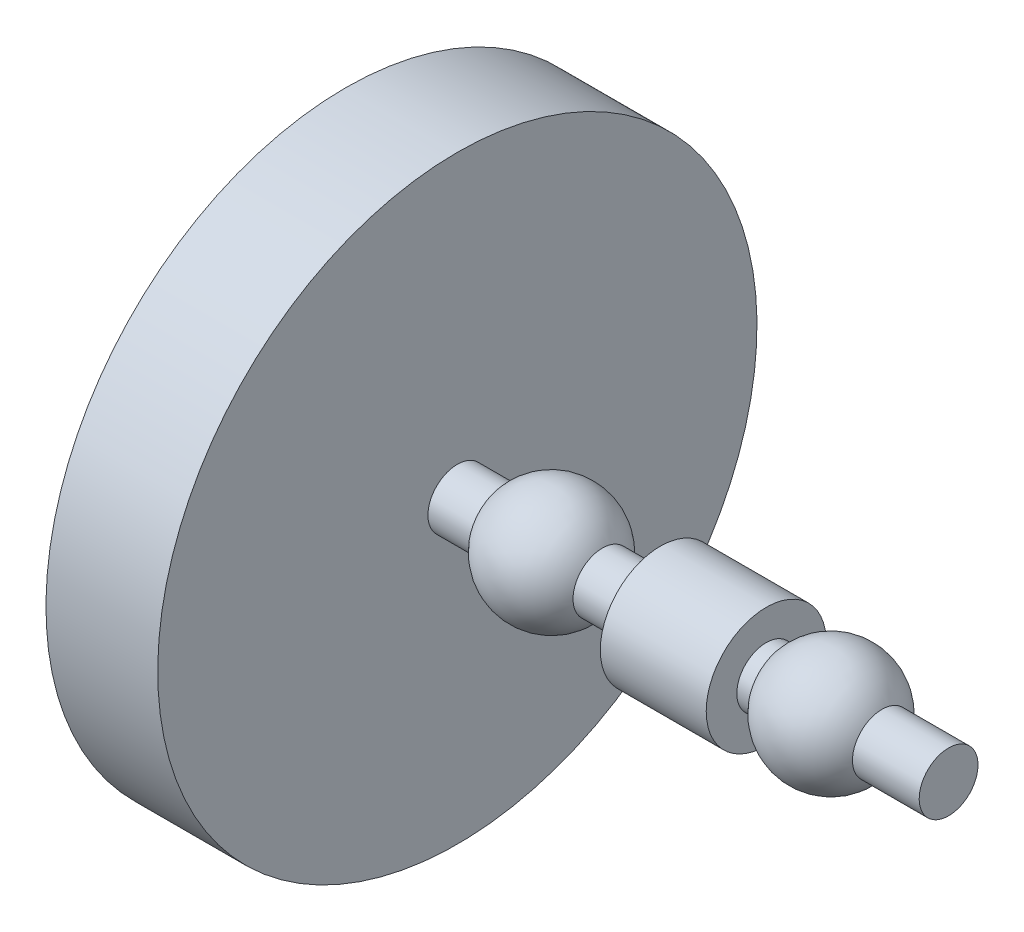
ISO-10303-21;
HEADER;
FILE_DESCRIPTION(('STEP AP214'),'2;1');
FILE_NAME('part.step','',(''),(''),'','','');
FILE_SCHEMA(('AUTOMOTIVE_DESIGN { 1 0 10303 214 1 1 1 1 }'));
ENDSEC;
DATA;
#1=APPLICATION_CONTEXT('core data for automotive mechanical design processes');
#2=APPLICATION_PROTOCOL_DEFINITION('international standard','automotive_design',2000,#1);
#3=PRODUCT_CONTEXT('',#1,'mechanical');
#4=PRODUCT('Part','Part','',(#3));
#5=PRODUCT_RELATED_PRODUCT_CATEGORY('part','',(#4));
#6=PRODUCT_DEFINITION_FORMATION('','',#4);
#7=PRODUCT_DEFINITION_CONTEXT('part definition',#1,'design');
#8=PRODUCT_DEFINITION('design','',#6,#7);
#9=PRODUCT_DEFINITION_SHAPE('','',#8);
#10=(LENGTH_UNIT() NAMED_UNIT(*) SI_UNIT(.MILLI.,.METRE.));
#11=(NAMED_UNIT(*) PLANE_ANGLE_UNIT() SI_UNIT($,.RADIAN.));
#12=(NAMED_UNIT(*) SI_UNIT($,.STERADIAN.) SOLID_ANGLE_UNIT());
#13=UNCERTAINTY_MEASURE_WITH_UNIT(LENGTH_MEASURE(1.E-05),#10,'distance_accuracy_value','');
#14=(GEOMETRIC_REPRESENTATION_CONTEXT(3) GLOBAL_UNCERTAINTY_ASSIGNED_CONTEXT((#13)) GLOBAL_UNIT_ASSIGNED_CONTEXT((#10,
#11,#12)) REPRESENTATION_CONTEXT('',''));
#15=CARTESIAN_POINT('',(0.,0.,0.));
#16=DIRECTION('',(0.,0.,1.));
#17=DIRECTION('',(1.,0.,0.));
#18=AXIS2_PLACEMENT_3D('',#15,#16,#17);
#19=CARTESIAN_POINT('',(0.,0.,0.));
#20=DIRECTION('',(1.,0.,0.));
#21=DIRECTION('',(0.,1.,0.));
#22=AXIS2_PLACEMENT_3D('',#19,#20,#21);
#23=CYLINDRICAL_SURFACE('',#22,5.);
#24=CARTESIAN_POINT('',(8.66025403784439,0.,0.));
#25=DIRECTION('',(1.,0.,0.));
#26=DIRECTION('',(0.,1.,0.));
#27=AXIS2_PLACEMENT_3D('',#24,#25,#26);
#28=CIRCLE('',#27,5.);
#29=CARTESIAN_POINT('',(8.66025403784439,5.,0.));
#30=VERTEX_POINT('',#29);
#31=EDGE_CURVE('E190',#30,#30,#28,.T.);
#32=ORIENTED_EDGE('',*,*,#31,.T.);
#33=EDGE_LOOP('',(#32));
#34=FACE_BOUND('',#33,.T.);
#35=CARTESIAN_POINT('',(18.5,0.,0.));
#36=DIRECTION('',(1.,0.,0.));
#37=DIRECTION('',(0.,0.,-1.));
#38=AXIS2_PLACEMENT_3D('',#35,#36,#37);
#39=CIRCLE('',#38,5.);
#40=CARTESIAN_POINT('',(18.5,0.,-5.));
#41=VERTEX_POINT('',#40);
#42=EDGE_CURVE('E37',#41,#41,#39,.F.);
#43=ORIENTED_EDGE('',*,*,#42,.T.);
#44=EDGE_LOOP('',(#43));
#45=FACE_BOUND('',#44,.T.);
#46=ADVANCED_FACE('F33',(#34,#45),#23,.T.);
#47=CARTESIAN_POINT('',(-35.,0.,0.));
#48=DIRECTION('',(-1.,0.,0.));
#49=DIRECTION('',(0.,-1.,0.));
#50=AXIS2_PLACEMENT_3D('',#47,#48,#49);
#51=PLANE('',#50);
#52=CARTESIAN_POINT('',(-35.,-1.,40.));
#53=DIRECTION('',(-1.,0.,0.));
#54=DIRECTION('',(0.,1.,0.));
#55=AXIS2_PLACEMENT_3D('',#52,#53,#54);
#56=CIRCLE('',#55,2.);
#57=CARTESIAN_POINT('',(-35.,-3.,40.));
#58=VERTEX_POINT('',#57);
#59=CARTESIAN_POINT('',(-35.,-1.,42.));
#60=VERTEX_POINT('',#59);
#61=EDGE_CURVE('E50',#58,#60,#56,.T.);
#62=ORIENTED_EDGE('',*,*,#61,.F.);
#63=DIRECTION('',(0.,0.,1.));
#64=VECTOR('',#63,1.);
#65=CARTESIAN_POINT('',(-35.,-3.,40.));
#66=LINE('',#65,#64);
#67=CARTESIAN_POINT('',(-35.,-3.,9.));
#68=VERTEX_POINT('',#67);
#69=EDGE_CURVE('E137',#68,#58,#66,.T.);
#70=ORIENTED_EDGE('',*,*,#69,.F.);
#71=CARTESIAN_POINT('',(-35.,-0.999999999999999,9.));
#72=DIRECTION('',(-1.,0.,0.));
#73=DIRECTION('',(0.,1.,0.));
#74=AXIS2_PLACEMENT_3D('',#71,#72,#73);
#75=CIRCLE('',#74,2.);
#76=CARTESIAN_POINT('',(-35.,-0.999999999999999,7.));
#77=VERTEX_POINT('',#76);
#78=EDGE_CURVE('E134',#77,#68,#75,.T.);
#79=ORIENTED_EDGE('',*,*,#78,.F.);
#80=DIRECTION('',(0.,-1.,0.));
#81=VECTOR('',#80,1.);
#82=CARTESIAN_POINT('',(-35.,0.999999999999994,7.));
#83=LINE('',#82,#81);
#84=CARTESIAN_POINT('',(-35.,0.999999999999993,7.));
#85=VERTEX_POINT('',#84);
#86=EDGE_CURVE('E131',#85,#77,#83,.T.);
#87=ORIENTED_EDGE('',*,*,#86,.F.);
#88=CARTESIAN_POINT('',(-35.,0.999999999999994,9.));
#89=DIRECTION('',(-1.,0.,0.));
#90=DIRECTION('',(0.,1.,0.));
#91=AXIS2_PLACEMENT_3D('',#88,#89,#90);
#92=CIRCLE('',#91,2.);
#93=CARTESIAN_POINT('',(-35.,2.99999999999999,9.));
#94=VERTEX_POINT('',#93);
#95=EDGE_CURVE('E125',#94,#85,#92,.T.);
#96=ORIENTED_EDGE('',*,*,#95,.F.);
#97=DIRECTION('',(0.,0.,-1.));
#98=VECTOR('',#97,1.);
#99=CARTESIAN_POINT('',(-35.,3.,40.));
#100=LINE('',#99,#98);
#101=CARTESIAN_POINT('',(-35.,3.,40.));
#102=VERTEX_POINT('',#101);
#103=EDGE_CURVE('E123',#102,#94,#100,.T.);
#104=ORIENTED_EDGE('',*,*,#103,.F.);
#105=CARTESIAN_POINT('',(-35.,0.999999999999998,40.));
#106=DIRECTION('',(-1.,0.,0.));
#107=DIRECTION('',(0.,1.,0.));
#108=AXIS2_PLACEMENT_3D('',#105,#106,#107);
#109=CIRCLE('',#108,2.);
#110=CARTESIAN_POINT('',(-35.,0.999999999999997,42.));
#111=VERTEX_POINT('',#110);
#112=EDGE_CURVE('E105',#111,#102,#109,.T.);
#113=ORIENTED_EDGE('',*,*,#112,.F.);
#114=DIRECTION('',(0.,1.,0.));
#115=VECTOR('',#114,1.);
#116=CARTESIAN_POINT('',(-35.,0.999999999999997,42.));
#117=LINE('',#116,#115);
#118=EDGE_CURVE('E116',#60,#111,#117,.T.);
#119=ORIENTED_EDGE('',*,*,#118,.F.);
#120=EDGE_LOOP('',(#62,#70,#79,#87,#96,#104,#113,#119));
#121=FACE_BOUND('',#120,.T.);
#122=CARTESIAN_POINT('',(-35.,0.,0.));
#123=DIRECTION('',(1.,0.,0.));
#124=DIRECTION('',(0.,1.,0.));
#125=AXIS2_PLACEMENT_3D('',#122,#123,#124);
#126=CIRCLE('',#125,50.93);
#127=CARTESIAN_POINT('',(-35.,50.93,0.));
#128=VERTEX_POINT('',#127);
#129=EDGE_CURVE('E178',#128,#128,#126,.T.);
#130=ORIENTED_EDGE('',*,*,#129,.F.);
#131=EDGE_LOOP('',(#130));
#132=FACE_BOUND('',#131,.T.);
#133=ADVANCED_FACE('F35',(#121,#132),#51,.T.);
#134=CARTESIAN_POINT('',(0.,0.,0.));
#135=DIRECTION('',(1.,0.,0.));
#136=DIRECTION('',(0.,1.,0.));
#137=AXIS2_PLACEMENT_3D('',#134,#135,#136);
#138=SPHERICAL_SURFACE('',#137,10.);
#139=CARTESIAN_POINT('',(-8.66025403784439,0.,0.));
#140=DIRECTION('',(1.,0.,0.));
#141=DIRECTION('',(0.,1.,0.));
#142=AXIS2_PLACEMENT_3D('',#139,#140,#141);
#143=CIRCLE('',#142,5.);
#144=CARTESIAN_POINT('',(-8.66025403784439,5.,0.));
#145=VERTEX_POINT('',#144);
#146=EDGE_CURVE('E187',#145,#145,#143,.T.);
#147=CARTESIAN_POINT('',(-8.66025403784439,5.,0.));
#148=CARTESIAN_POINT('',(-8.55118010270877,5.18894351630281,0.));
#149=CARTESIAN_POINT('',(-8.43590517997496,5.37430545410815,0.));
#150=CARTESIAN_POINT('',(-8.19348706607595,5.73709920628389,0.));
#151=CARTESIAN_POINT('',(-8.06634387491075,5.91453102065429,0.));
#152=CARTESIAN_POINT('',(-7.80072293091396,6.26069755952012,0.));
#153=CARTESIAN_POINT('',(-7.66224517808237,6.42943228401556,0.));
#154=CARTESIAN_POINT('',(-7.37455097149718,6.75748401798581,0.));
#155=CARTESIAN_POINT('',(-7.22533451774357,6.91680102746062,0.));
#156=CARTESIAN_POINT('',(-6.91680110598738,7.22533459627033,0.));
#157=CARTESIAN_POINT('',(-6.7574841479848,7.37455115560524,0.));
#158=CARTESIAN_POINT('',(-6.42943215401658,7.66224499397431,0.));
#159=CARTESIAN_POINT('',(-6.26069711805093,7.80072227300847,0.));
#160=CARTESIAN_POINT('',(-5.91453146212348,8.06634453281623,0.));
#161=CARTESIAN_POINT('',(-5.73710084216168,8.19348951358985,0.));
#162=CARTESIAN_POINT('',(-5.37430381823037,8.43590273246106,0.));
#163=CARTESIAN_POINT('',(-5.18893741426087,8.55117097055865,0.));
#164=CARTESIAN_POINT('',(-4.81106258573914,8.76933710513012,0.));
#165=CARTESIAN_POINT('',(-4.61855416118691,8.87223500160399,0.));
#166=CARTESIAN_POINT('',(-4.22721964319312,9.06521982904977,0.));
#167=CARTESIAN_POINT('',(-4.02839354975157,9.15530676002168,0.));
#168=CARTESIAN_POINT('',(-3.62527509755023,9.32228389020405,0.));
#169=CARTESIAN_POINT('',(-3.42098273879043,9.3991740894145,0.));
#170=CARTESIAN_POINT('',(-3.00780656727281,9.53942850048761,0.));
#171=CARTESIAN_POINT('',(-2.79892275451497,9.60279271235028,0.));
#172=CARTESIAN_POINT('',(-2.37745814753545,9.71572381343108,0.));
#173=CARTESIAN_POINT('',(-2.16487735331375,9.76529070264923,0.));
#174=CARTESIAN_POINT('',(-1.73692908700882,9.85041490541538,0.));
#175=CARTESIAN_POINT('',(-1.5215616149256,9.88597221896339,0.));
#176=CARTESIAN_POINT('',(-1.08896222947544,9.94292500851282,0.));
#177=CARTESIAN_POINT('',(-0.871730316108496,9.96432048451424,0.));
#178=CARTESIAN_POINT('',(-0.436332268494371,9.99285798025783,0.));
#179=CARTESIAN_POINT('',(-0.218166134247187,10.,0.));
#180=CARTESIAN_POINT('',(0.218166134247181,10.,0.));
#181=CARTESIAN_POINT('',(0.436332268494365,9.99285798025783,0.));
#182=CARTESIAN_POINT('',(0.87173031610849,9.96432048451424,0.));
#183=CARTESIAN_POINT('',(1.08896222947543,9.94292500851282,0.));
#184=CARTESIAN_POINT('',(1.5215616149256,9.88597221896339,0.));
#185=CARTESIAN_POINT('',(1.73692908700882,9.85041490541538,0.));
#186=CARTESIAN_POINT('',(2.16487735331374,9.76529070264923,0.));
#187=CARTESIAN_POINT('',(2.37745814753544,9.71572381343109,0.));
#188=CARTESIAN_POINT('',(2.79892275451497,9.60279271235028,0.));
#189=CARTESIAN_POINT('',(3.0078065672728,9.53942850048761,0.));
#190=CARTESIAN_POINT('',(3.42098273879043,9.3991740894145,0.));
#191=CARTESIAN_POINT('',(3.62527509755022,9.32228389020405,0.));
#192=CARTESIAN_POINT('',(4.02839354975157,9.15530676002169,0.));
#193=CARTESIAN_POINT('',(4.22721964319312,9.06521982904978,0.));
#194=CARTESIAN_POINT('',(4.6185541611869,8.87223500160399,0.));
#195=CARTESIAN_POINT('',(4.81106258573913,8.76933710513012,0.));
#196=CARTESIAN_POINT('',(5.18893741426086,8.55117097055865,0.));
#197=CARTESIAN_POINT('',(5.37430381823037,8.43590273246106,0.));
#198=CARTESIAN_POINT('',(5.73710084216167,8.19348951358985,0.));
#199=CARTESIAN_POINT('',(5.91453146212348,8.06634453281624,0.));
#200=CARTESIAN_POINT('',(6.26069711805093,7.80072227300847,0.));
#201=CARTESIAN_POINT('',(6.42943215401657,7.66224499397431,0.));
#202=CARTESIAN_POINT('',(6.7574841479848,7.37455115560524,0.));
#203=CARTESIAN_POINT('',(6.91680110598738,7.22533459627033,0.));
#204=CARTESIAN_POINT('',(7.22533451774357,6.91680102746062,0.));
#205=CARTESIAN_POINT('',(7.37455097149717,6.75748401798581,0.));
#206=CARTESIAN_POINT('',(7.66224517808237,6.42943228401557,0.));
#207=CARTESIAN_POINT('',(7.80072293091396,6.26069755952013,0.));
#208=CARTESIAN_POINT('',(8.06634387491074,5.91453102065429,0.));
#209=CARTESIAN_POINT('',(8.19348706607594,5.73709920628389,0.));
#210=CARTESIAN_POINT('',(8.43590517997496,5.37430545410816,0.));
#211=CARTESIAN_POINT('',(8.55118010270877,5.18894351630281,0.));
#212=CARTESIAN_POINT('',(8.66025403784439,5.,0.));
#213=B_SPLINE_CURVE_WITH_KNOTS('',3,(#147,#148,#149,#150,#151,#152,#153,#154,#155,#156,#157,
#158,#159,#160,#161,#162,#163,#164,#165,#166,#167,#168,#169,#170,#171,#172,#173,#174,#175,#176,
#177,#178,#179,#180,#181,#182,#183,#184,#185,#186,#187,#188,#189,#190,#191,#192,#193,#194,#195,
#196,#197,#198,#199,#200,#201,#202,#203,#204,#205,#206,#207,#208,#209,#210,#211,#212),
.UNSPECIFIED.,.F.,.F.,(4,2,2,2,2,2,2,2,2,2,2,2,2,2,2,2,2,2,2,2,2,2,2,2,2,2,2,2,2,2,2,2,4),(0.,
0.654381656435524,1.30876331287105,1.96314496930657,2.61752662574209,3.27190828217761,
3.92628993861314,4.58067159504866,5.23505325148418,5.88943490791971,6.54381656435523,
7.19819822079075,7.85257987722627,8.5069615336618,9.16134319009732,9.81572484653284,
10.4701065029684,11.1244881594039,11.7788698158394,12.4332514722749,13.0876331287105,
13.742014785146,14.3963964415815,15.050778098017,15.7051597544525,16.3595414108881,
17.0139230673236,17.6683047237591,18.3226863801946,18.9770680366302,19.6314496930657,
20.2858313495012,20.9402130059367),.UNSPECIFIED.);
#214=EDGE_CURVE('BSEAM235',#145,#30,#213,.T.);
#215=ORIENTED_EDGE('',*,*,#146,.T.);
#216=ORIENTED_EDGE('',*,*,#31,.F.);
#217=ORIENTED_EDGE('',*,*,#214,.T.);
#218=ORIENTED_EDGE('',*,*,#214,.F.);
#219=EDGE_LOOP('',(#215,#217,#216,#218));
#220=FACE_BOUND('',#219,.T.);
#221=ADVANCED_FACE('F235',(#220),#138,.T.);
#222=CARTESIAN_POINT('',(0.,0.,0.));
#223=DIRECTION('',(1.,0.,0.));
#224=DIRECTION('',(0.,1.,0.));
#225=AXIS2_PLACEMENT_3D('',#222,#223,#224);
#226=CYLINDRICAL_SURFACE('',#225,5.);
#227=CARTESIAN_POINT('',(-16.,0.,0.));
#228=DIRECTION('',(1.,0.,0.));
#229=DIRECTION('',(0.,1.,0.));
#230=AXIS2_PLACEMENT_3D('',#227,#228,#229);
#231=CIRCLE('',#230,5.);
#232=CARTESIAN_POINT('',(-16.,5.,0.));
#233=VERTEX_POINT('',#232);
#234=EDGE_CURVE('E184',#233,#233,#231,.T.);
#235=ORIENTED_EDGE('',*,*,#234,.T.);
#236=EDGE_LOOP('',(#235));
#237=FACE_BOUND('',#236,.T.);
#238=ORIENTED_EDGE('',*,*,#146,.F.);
#239=EDGE_LOOP('',(#238));
#240=FACE_BOUND('',#239,.T.);
#241=ADVANCED_FACE('F273',(#237,#240),#226,.T.);
#242=CARTESIAN_POINT('',(-16.,5.,0.));
#243=DIRECTION('',(1.,0.,0.));
#244=DIRECTION('',(0.,1.,0.));
#245=AXIS2_PLACEMENT_3D('',#242,#243,#244);
#246=PLANE('',#245);
#247=CARTESIAN_POINT('',(-16.,0.,0.));
#248=DIRECTION('',(1.,0.,0.));
#249=DIRECTION('',(0.,1.,0.));
#250=AXIS2_PLACEMENT_3D('',#247,#248,#249);
#251=CIRCLE('',#250,50.93);
#252=CARTESIAN_POINT('',(-16.,50.93,0.));
#253=VERTEX_POINT('',#252);
#254=EDGE_CURVE('E181',#253,#253,#251,.T.);
#255=ORIENTED_EDGE('',*,*,#254,.T.);
#256=EDGE_LOOP('',(#255));
#257=FACE_BOUND('',#256,.T.);
#258=ORIENTED_EDGE('',*,*,#234,.F.);
#259=EDGE_LOOP('',(#258));
#260=FACE_BOUND('',#259,.T.);
#261=ADVANCED_FACE('F282',(#257,#260),#246,.T.);
#262=CARTESIAN_POINT('',(0.,0.,0.));
#263=DIRECTION('',(1.,0.,0.));
#264=DIRECTION('',(0.,1.,0.));
#265=AXIS2_PLACEMENT_3D('',#262,#263,#264);
#266=CYLINDRICAL_SURFACE('',#265,50.93);
#267=ORIENTED_EDGE('',*,*,#129,.T.);
#268=EDGE_LOOP('',(#267));
#269=FACE_BOUND('',#268,.T.);
#270=ORIENTED_EDGE('',*,*,#254,.F.);
#271=EDGE_LOOP('',(#270));
#272=FACE_BOUND('',#271,.T.);
#273=ADVANCED_FACE('F208',(#269,#272),#266,.T.);
#274=CARTESIAN_POINT('',(18.5,0.,0.));
#275=DIRECTION('',(1.,0.,0.));
#276=DIRECTION('',(0.,0.,-1.));
#277=AXIS2_PLACEMENT_3D('',#274,#275,#276);
#278=PLANE('',#277);
#279=ORIENTED_EDGE('',*,*,#42,.F.);
#280=EDGE_LOOP('',(#279));
#281=FACE_BOUND('',#280,.T.);
#282=CARTESIAN_POINT('',(18.5,0.,0.));
#283=DIRECTION('',(-1.,0.,0.));
#284=DIRECTION('',(0.,0.,1.));
#285=AXIS2_PLACEMENT_3D('',#282,#283,#284);
#286=CIRCLE('',#285,10.2);
#287=CARTESIAN_POINT('',(18.5,0.,10.2));
#288=VERTEX_POINT('',#287);
#289=EDGE_CURVE('E174',#288,#288,#286,.T.);
#290=ORIENTED_EDGE('',*,*,#289,.T.);
#291=EDGE_LOOP('',(#290));
#292=FACE_BOUND('',#291,.T.);
#293=ADVANCED_FACE('F204',(#281,#292),#278,.F.);
#294=CARTESIAN_POINT('',(0.,0.,0.));
#295=DIRECTION('',(-1.,0.,0.));
#296=DIRECTION('',(0.,0.,1.));
#297=AXIS2_PLACEMENT_3D('',#294,#295,#296);
#298=CYLINDRICAL_SURFACE('',#297,10.2);
#299=ORIENTED_EDGE('',*,*,#289,.F.);
#300=EDGE_LOOP('',(#299));
#301=FACE_BOUND('',#300,.T.);
#302=CARTESIAN_POINT('',(36.5,0.,0.));
#303=DIRECTION('',(-1.,0.,0.));
#304=DIRECTION('',(0.,0.,1.));
#305=AXIS2_PLACEMENT_3D('',#302,#303,#304);
#306=CIRCLE('',#305,10.2);
#307=CARTESIAN_POINT('',(36.5,0.,10.2));
#308=VERTEX_POINT('',#307);
#309=EDGE_CURVE('E161',#308,#308,#306,.T.);
#310=ORIENTED_EDGE('',*,*,#309,.T.);
#311=EDGE_LOOP('',(#310));
#312=FACE_BOUND('',#311,.T.);
#313=ADVANCED_FACE('F207',(#301,#312),#298,.T.);
#314=CARTESIAN_POINT('',(36.5,0.,0.));
#315=DIRECTION('',(-1.,0.,0.));
#316=DIRECTION('',(0.,0.,1.));
#317=AXIS2_PLACEMENT_3D('',#314,#315,#316);
#318=PLANE('',#317);
#319=CARTESIAN_POINT('',(36.5,0.,0.));
#320=DIRECTION('',(-1.,0.,0.));
#321=DIRECTION('',(0.,0.,1.));
#322=AXIS2_PLACEMENT_3D('',#319,#320,#321);
#323=CIRCLE('',#322,5.);
#324=CARTESIAN_POINT('',(36.5,0.,5.));
#325=VERTEX_POINT('',#324);
#326=EDGE_CURVE('E177',#325,#325,#323,.F.);
#327=ORIENTED_EDGE('',*,*,#326,.F.);
#328=EDGE_LOOP('',(#327));
#329=FACE_BOUND('',#328,.T.);
#330=ORIENTED_EDGE('',*,*,#309,.F.);
#331=EDGE_LOOP('',(#330));
#332=FACE_BOUND('',#331,.T.);
#333=ADVANCED_FACE('F214',(#329,#332),#318,.F.);
#334=CARTESIAN_POINT('',(67.5,0.,0.));
#335=DIRECTION('',(1.,0.,0.));
#336=DIRECTION('',(0.,1.,0.));
#337=AXIS2_PLACEMENT_3D('',#334,#335,#336);
#338=PLANE('',#337);
#339=CARTESIAN_POINT('',(67.5,0.,0.));
#340=DIRECTION('',(1.,0.,0.));
#341=DIRECTION('',(0.,1.,0.));
#342=AXIS2_PLACEMENT_3D('',#339,#340,#341);
#343=CIRCLE('',#342,5.);
#344=CARTESIAN_POINT('',(67.5,5.,0.));
#345=VERTEX_POINT('',#344);
#346=EDGE_CURVE('E11',#345,#345,#343,.T.);
#347=ORIENTED_EDGE('',*,*,#346,.T.);
#348=EDGE_LOOP('',(#347));
#349=FACE_BOUND('',#348,.T.);
#350=ADVANCED_FACE('F219',(#349),#338,.T.);
#351=CARTESIAN_POINT('',(0.,0.,0.));
#352=DIRECTION('',(1.,0.,0.));
#353=DIRECTION('',(0.,1.,0.));
#354=AXIS2_PLACEMENT_3D('',#351,#352,#353);
#355=CYLINDRICAL_SURFACE('',#354,5.);
#356=CARTESIAN_POINT('',(56.1602540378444,0.,0.));
#357=DIRECTION('',(1.,0.,0.));
#358=DIRECTION('',(0.,1.,0.));
#359=AXIS2_PLACEMENT_3D('',#356,#357,#358);
#360=CIRCLE('',#359,5.);
#361=CARTESIAN_POINT('',(56.1602540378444,5.00000000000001,0.));
#362=VERTEX_POINT('',#361);
#363=EDGE_CURVE('E42',#362,#362,#360,.T.);
#364=ORIENTED_EDGE('',*,*,#363,.T.);
#365=EDGE_LOOP('',(#364));
#366=FACE_BOUND('',#365,.T.);
#367=ORIENTED_EDGE('',*,*,#346,.F.);
#368=EDGE_LOOP('',(#367));
#369=FACE_BOUND('',#368,.T.);
#370=ADVANCED_FACE('F225',(#366,#369),#355,.T.);
#371=CARTESIAN_POINT('',(47.5,0.,0.));
#372=DIRECTION('',(1.,0.,0.));
#373=DIRECTION('',(0.,1.,0.));
#374=AXIS2_PLACEMENT_3D('',#371,#372,#373);
#375=SPHERICAL_SURFACE('',#374,10.);
#376=CARTESIAN_POINT('',(38.8397459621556,0.,0.));
#377=DIRECTION('',(1.,0.,0.));
#378=DIRECTION('',(0.,1.,0.));
#379=AXIS2_PLACEMENT_3D('',#376,#377,#378);
#380=CIRCLE('',#379,5.);
#381=CARTESIAN_POINT('',(38.8397459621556,4.99999999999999,0.));
#382=VERTEX_POINT('',#381);
#383=EDGE_CURVE('E193',#382,#382,#380,.T.);
#384=CARTESIAN_POINT('',(38.8397459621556,4.99999999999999,0.));
#385=CARTESIAN_POINT('',(38.9488198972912,5.1889435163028,0.));
#386=CARTESIAN_POINT('',(39.064094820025,5.37430545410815,0.));
#387=CARTESIAN_POINT('',(39.306512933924,5.73709920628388,0.));
#388=CARTESIAN_POINT('',(39.4336561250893,5.91453102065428,0.));
#389=CARTESIAN_POINT('',(39.699277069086,6.26069755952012,0.));
#390=CARTESIAN_POINT('',(39.8377548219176,6.42943228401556,0.));
#391=CARTESIAN_POINT('',(40.1254490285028,6.7574840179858,0.));
#392=CARTESIAN_POINT('',(40.2746654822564,6.91680102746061,0.));
#393=CARTESIAN_POINT('',(40.5831988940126,7.22533459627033,0.));
#394=CARTESIAN_POINT('',(40.7425158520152,7.37455115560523,0.));
#395=CARTESIAN_POINT('',(41.0705678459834,7.6622449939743,0.));
#396=CARTESIAN_POINT('',(41.2393028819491,7.80072227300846,0.));
#397=CARTESIAN_POINT('',(41.5854685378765,8.06634453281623,0.));
#398=CARTESIAN_POINT('',(41.7628991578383,8.19348951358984,0.));
#399=CARTESIAN_POINT('',(42.1256961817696,8.43590273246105,0.));
#400=CARTESIAN_POINT('',(42.3110625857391,8.55117097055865,0.));
#401=CARTESIAN_POINT('',(42.6889374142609,8.76933710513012,0.));
#402=CARTESIAN_POINT('',(42.8814458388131,8.87223500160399,0.));
#403=CARTESIAN_POINT('',(43.2727803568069,9.06521982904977,0.));
#404=CARTESIAN_POINT('',(43.4716064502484,9.15530676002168,0.));
#405=CARTESIAN_POINT('',(43.8747249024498,9.32228389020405,0.));
#406=CARTESIAN_POINT('',(44.0790172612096,9.3991740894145,0.));
#407=CARTESIAN_POINT('',(44.4921934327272,9.53942850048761,0.));
#408=CARTESIAN_POINT('',(44.701077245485,9.60279271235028,0.));
#409=CARTESIAN_POINT('',(45.1225418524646,9.71572381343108,0.));
#410=CARTESIAN_POINT('',(45.3351226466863,9.76529070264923,0.));
#411=CARTESIAN_POINT('',(45.7630709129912,9.85041490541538,0.));
#412=CARTESIAN_POINT('',(45.9784383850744,9.88597221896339,0.));
#413=CARTESIAN_POINT('',(46.4110377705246,9.94292500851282,0.));
#414=CARTESIAN_POINT('',(46.6282696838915,9.96432048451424,0.));
#415=CARTESIAN_POINT('',(47.0636677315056,9.99285798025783,0.));
#416=CARTESIAN_POINT('',(47.2818338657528,10.,0.));
#417=CARTESIAN_POINT('',(47.7181661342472,10.,0.));
#418=CARTESIAN_POINT('',(47.9363322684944,9.99285798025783,0.));
#419=CARTESIAN_POINT('',(48.3717303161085,9.96432048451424,0.));
#420=CARTESIAN_POINT('',(48.5889622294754,9.94292500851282,0.));
#421=CARTESIAN_POINT('',(49.0215616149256,9.88597221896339,0.));
#422=CARTESIAN_POINT('',(49.2369290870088,9.85041490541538,0.));
#423=CARTESIAN_POINT('',(49.6648773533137,9.76529070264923,0.));
#424=CARTESIAN_POINT('',(49.8774581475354,9.71572381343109,0.));
#425=CARTESIAN_POINT('',(50.298922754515,9.60279271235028,0.));
#426=CARTESIAN_POINT('',(50.5078065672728,9.53942850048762,0.));
#427=CARTESIAN_POINT('',(50.9209827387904,9.3991740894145,0.));
#428=CARTESIAN_POINT('',(51.1252750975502,9.32228389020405,0.));
#429=CARTESIAN_POINT('',(51.5283935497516,9.15530676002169,0.));
#430=CARTESIAN_POINT('',(51.7272196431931,9.06521982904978,0.));
#431=CARTESIAN_POINT('',(52.1185541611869,8.87223500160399,0.));
#432=CARTESIAN_POINT('',(52.3110625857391,8.76933710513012,0.));
#433=CARTESIAN_POINT('',(52.6889374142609,8.55117097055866,0.));
#434=CARTESIAN_POINT('',(52.8743038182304,8.43590273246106,0.));
#435=CARTESIAN_POINT('',(53.2371008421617,8.19348951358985,0.));
#436=CARTESIAN_POINT('',(53.4145314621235,8.06634453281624,0.));
#437=CARTESIAN_POINT('',(53.7606971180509,7.80072227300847,0.));
#438=CARTESIAN_POINT('',(53.9294321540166,7.66224499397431,0.));
#439=CARTESIAN_POINT('',(54.2574841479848,7.37455115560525,0.));
#440=CARTESIAN_POINT('',(54.4168011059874,7.22533459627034,0.));
#441=CARTESIAN_POINT('',(54.7253345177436,6.91680102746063,0.));
#442=CARTESIAN_POINT('',(54.8745509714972,6.75748401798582,0.));
#443=CARTESIAN_POINT('',(55.1622451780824,6.42943228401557,0.));
#444=CARTESIAN_POINT('',(55.300722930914,6.26069755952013,0.));
#445=CARTESIAN_POINT('',(55.5663438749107,5.9145310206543,0.));
#446=CARTESIAN_POINT('',(55.6934870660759,5.7370992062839,0.));
#447=CARTESIAN_POINT('',(55.935905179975,5.37430545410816,0.));
#448=CARTESIAN_POINT('',(56.0511801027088,5.18894351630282,0.));
#449=CARTESIAN_POINT('',(56.1602540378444,5.00000000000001,0.));
#450=B_SPLINE_CURVE_WITH_KNOTS('',3,(#384,#385,#386,#387,#388,#389,#390,#391,#392,#393,#394,
#395,#396,#397,#398,#399,#400,#401,#402,#403,#404,#405,#406,#407,#408,#409,#410,#411,#412,#413,
#414,#415,#416,#417,#418,#419,#420,#421,#422,#423,#424,#425,#426,#427,#428,#429,#430,#431,#432,
#433,#434,#435,#436,#437,#438,#439,#440,#441,#442,#443,#444,#445,#446,#447,#448,#449),
.UNSPECIFIED.,.F.,.F.,(4,2,2,2,2,2,2,2,2,2,2,2,2,2,2,2,2,2,2,2,2,2,2,2,2,2,2,2,2,2,2,2,4),(0.,
0.654381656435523,1.30876331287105,1.96314496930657,2.61752662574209,3.27190828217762,
3.92628993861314,4.58067159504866,5.23505325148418,5.88943490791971,6.54381656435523,
7.19819822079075,7.85257987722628,8.5069615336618,9.16134319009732,9.81572484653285,
10.4701065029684,11.1244881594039,11.7788698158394,12.4332514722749,13.0876331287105,
13.742014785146,14.3963964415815,15.050778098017,15.7051597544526,16.3595414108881,
17.0139230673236,17.6683047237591,18.3226863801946,18.9770680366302,19.6314496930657,
20.2858313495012,20.9402130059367),.UNSPECIFIED.);
#451=EDGE_CURVE('BSEAM240',#382,#362,#450,.T.);
#452=ORIENTED_EDGE('',*,*,#383,.T.);
#453=ORIENTED_EDGE('',*,*,#363,.F.);
#454=ORIENTED_EDGE('',*,*,#451,.T.);
#455=ORIENTED_EDGE('',*,*,#451,.F.);
#456=EDGE_LOOP('',(#452,#454,#453,#455));
#457=FACE_BOUND('',#456,.T.);
#458=ADVANCED_FACE('F240',(#457),#375,.T.);
#459=ORIENTED_EDGE('',*,*,#383,.F.);
#460=EDGE_LOOP('',(#459));
#461=FACE_BOUND('',#460,.T.);
#462=ORIENTED_EDGE('',*,*,#326,.T.);
#463=EDGE_LOOP('',(#462));
#464=FACE_BOUND('',#463,.T.);
#465=ADVANCED_FACE('F231',(#461,#464),#23,.T.);
#466=CARTESIAN_POINT('',(-32.,-1.,40.));
#467=DIRECTION('',(-1.,0.,0.));
#468=DIRECTION('',(0.,-1.,0.));
#469=AXIS2_PLACEMENT_3D('',#466,#467,#468);
#470=CYLINDRICAL_SURFACE('',#469,2.);
#471=ORIENTED_EDGE('',*,*,#61,.T.);
#472=DIRECTION('',(-1.,0.,0.));
#473=VECTOR('',#472,1.);
#474=CARTESIAN_POINT('',(-32.,-1.,42.));
#475=LINE('',#474,#473);
#476=CARTESIAN_POINT('',(-32.,-1.,42.));
#477=VERTEX_POINT('',#476);
#478=EDGE_CURVE('E113',#477,#60,#475,.T.);
#479=ORIENTED_EDGE('',*,*,#478,.F.);
#480=CARTESIAN_POINT('',(-32.,-1.,40.));
#481=DIRECTION('',(-1.,0.,0.));
#482=DIRECTION('',(0.,1.,0.));
#483=AXIS2_PLACEMENT_3D('',#480,#481,#482);
#484=CIRCLE('',#483,2.);
#485=CARTESIAN_POINT('',(-32.,-3.,40.));
#486=VERTEX_POINT('',#485);
#487=EDGE_CURVE('E139',#486,#477,#484,.T.);
#488=ORIENTED_EDGE('',*,*,#487,.F.);
#489=DIRECTION('',(-1.,0.,0.));
#490=VECTOR('',#489,1.);
#491=CARTESIAN_POINT('',(-32.,-3.,40.));
#492=LINE('',#491,#490);
#493=EDGE_CURVE('E57',#486,#58,#492,.T.);
#494=ORIENTED_EDGE('',*,*,#493,.T.);
#495=EDGE_LOOP('',(#471,#479,#488,#494));
#496=FACE_BOUND('',#495,.T.);
#497=ADVANCED_FACE('F239',(#496),#470,.F.);
#498=CARTESIAN_POINT('',(-32.,-3.,40.));
#499=DIRECTION('',(0.,-1.,0.));
#500=DIRECTION('',(0.,0.,-1.));
#501=AXIS2_PLACEMENT_3D('',#498,#499,#500);
#502=PLANE('',#501);
#503=ORIENTED_EDGE('',*,*,#69,.T.);
#504=ORIENTED_EDGE('',*,*,#493,.F.);
#505=DIRECTION('',(0.,0.,1.));
#506=VECTOR('',#505,1.);
#507=CARTESIAN_POINT('',(-32.,-3.,40.));
#508=LINE('',#507,#506);
#509=CARTESIAN_POINT('',(-32.,-3.,9.));
#510=VERTEX_POINT('',#509);
#511=EDGE_CURVE('E157',#510,#486,#508,.T.);
#512=ORIENTED_EDGE('',*,*,#511,.F.);
#513=DIRECTION('',(-1.,0.,0.));
#514=VECTOR('',#513,1.);
#515=CARTESIAN_POINT('',(-32.,-3.,9.));
#516=LINE('',#515,#514);
#517=EDGE_CURVE('E162',#510,#68,#516,.T.);
#518=ORIENTED_EDGE('',*,*,#517,.T.);
#519=EDGE_LOOP('',(#503,#504,#512,#518));
#520=FACE_BOUND('',#519,.T.);
#521=ADVANCED_FACE('F246',(#520),#502,.F.);
#522=CARTESIAN_POINT('',(-32.,-0.999999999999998,9.));
#523=DIRECTION('',(-1.,0.,0.));
#524=DIRECTION('',(0.,-1.,0.));
#525=AXIS2_PLACEMENT_3D('',#522,#523,#524);
#526=CYLINDRICAL_SURFACE('',#525,2.);
#527=ORIENTED_EDGE('',*,*,#78,.T.);
#528=ORIENTED_EDGE('',*,*,#517,.F.);
#529=CARTESIAN_POINT('',(-32.,-0.999999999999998,9.));
#530=DIRECTION('',(-1.,0.,0.));
#531=DIRECTION('',(0.,1.,0.));
#532=AXIS2_PLACEMENT_3D('',#529,#530,#531);
#533=CIRCLE('',#532,2.);
#534=CARTESIAN_POINT('',(-32.,-0.999999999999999,7.));
#535=VERTEX_POINT('',#534);
#536=EDGE_CURVE('E154',#535,#510,#533,.T.);
#537=ORIENTED_EDGE('',*,*,#536,.F.);
#538=DIRECTION('',(-1.,0.,0.));
#539=VECTOR('',#538,1.);
#540=CARTESIAN_POINT('',(-32.,-0.999999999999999,7.));
#541=LINE('',#540,#539);
#542=EDGE_CURVE('E164',#535,#77,#541,.T.);
#543=ORIENTED_EDGE('',*,*,#542,.T.);
#544=EDGE_LOOP('',(#527,#528,#537,#543));
#545=FACE_BOUND('',#544,.T.);
#546=ADVANCED_FACE('F347',(#545),#526,.F.);
#547=CARTESIAN_POINT('',(-32.,0.999999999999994,7.));
#548=DIRECTION('',(0.,0.,-1.));
#549=DIRECTION('',(-1.,0.,0.));
#550=AXIS2_PLACEMENT_3D('',#547,#548,#549);
#551=PLANE('',#550);
#552=ORIENTED_EDGE('',*,*,#86,.T.);
#553=ORIENTED_EDGE('',*,*,#542,.F.);
#554=DIRECTION('',(0.,-1.,0.));
#555=VECTOR('',#554,1.);
#556=CARTESIAN_POINT('',(-32.,0.999999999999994,7.));
#557=LINE('',#556,#555);
#558=CARTESIAN_POINT('',(-32.,0.999999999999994,7.));
#559=VERTEX_POINT('',#558);
#560=EDGE_CURVE('E151',#559,#535,#557,.T.);
#561=ORIENTED_EDGE('',*,*,#560,.F.);
#562=DIRECTION('',(-1.,0.,0.));
#563=VECTOR('',#562,1.);
#564=CARTESIAN_POINT('',(-32.,0.999999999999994,7.));
#565=LINE('',#564,#563);
#566=EDGE_CURVE('E166',#559,#85,#565,.T.);
#567=ORIENTED_EDGE('',*,*,#566,.T.);
#568=EDGE_LOOP('',(#552,#553,#561,#567));
#569=FACE_BOUND('',#568,.T.);
#570=ADVANCED_FACE('F356',(#569),#551,.F.);
#571=CARTESIAN_POINT('',(-32.,0.999999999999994,9.));
#572=DIRECTION('',(-1.,0.,0.));
#573=DIRECTION('',(0.,-1.,0.));
#574=AXIS2_PLACEMENT_3D('',#571,#572,#573);
#575=CYLINDRICAL_SURFACE('',#574,2.);
#576=ORIENTED_EDGE('',*,*,#95,.T.);
#577=ORIENTED_EDGE('',*,*,#566,.F.);
#578=CARTESIAN_POINT('',(-32.,0.999999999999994,9.));
#579=DIRECTION('',(-1.,0.,0.));
#580=DIRECTION('',(0.,1.,0.));
#581=AXIS2_PLACEMENT_3D('',#578,#579,#580);
#582=CIRCLE('',#581,2.);
#583=CARTESIAN_POINT('',(-32.,2.99999999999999,9.));
#584=VERTEX_POINT('',#583);
#585=EDGE_CURVE('E148',#584,#559,#582,.T.);
#586=ORIENTED_EDGE('',*,*,#585,.F.);
#587=DIRECTION('',(-1.,0.,0.));
#588=VECTOR('',#587,1.);
#589=CARTESIAN_POINT('',(-32.,2.99999999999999,9.));
#590=LINE('',#589,#588);
#591=EDGE_CURVE('E168',#584,#94,#590,.T.);
#592=ORIENTED_EDGE('',*,*,#591,.T.);
#593=EDGE_LOOP('',(#576,#577,#586,#592));
#594=FACE_BOUND('',#593,.T.);
#595=ADVANCED_FACE('F366',(#594),#575,.F.);
#596=CARTESIAN_POINT('',(-32.,3.,40.));
#597=DIRECTION('',(0.,1.,0.));
#598=DIRECTION('',(0.,0.,1.));
#599=AXIS2_PLACEMENT_3D('',#596,#597,#598);
#600=PLANE('',#599);
#601=ORIENTED_EDGE('',*,*,#103,.T.);
#602=ORIENTED_EDGE('',*,*,#591,.F.);
#603=DIRECTION('',(0.,0.,-1.));
#604=VECTOR('',#603,1.);
#605=CARTESIAN_POINT('',(-32.,3.,40.));
#606=LINE('',#605,#604);
#607=CARTESIAN_POINT('',(-32.,3.,40.));
#608=VERTEX_POINT('',#607);
#609=EDGE_CURVE('E145',#608,#584,#606,.T.);
#610=ORIENTED_EDGE('',*,*,#609,.F.);
#611=DIRECTION('',(-1.,0.,0.));
#612=VECTOR('',#611,1.);
#613=CARTESIAN_POINT('',(-32.,3.,40.));
#614=LINE('',#613,#612);
#615=EDGE_CURVE('E112',#608,#102,#614,.T.);
#616=ORIENTED_EDGE('',*,*,#615,.T.);
#617=EDGE_LOOP('',(#601,#602,#610,#616));
#618=FACE_BOUND('',#617,.T.);
#619=ADVANCED_FACE('F376',(#618),#600,.F.);
#620=CARTESIAN_POINT('',(-32.,0.999999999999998,40.));
#621=DIRECTION('',(-1.,0.,0.));
#622=DIRECTION('',(0.,-1.,0.));
#623=AXIS2_PLACEMENT_3D('',#620,#621,#622);
#624=CYLINDRICAL_SURFACE('',#623,2.);
#625=ORIENTED_EDGE('',*,*,#112,.T.);
#626=ORIENTED_EDGE('',*,*,#615,.F.);
#627=CARTESIAN_POINT('',(-32.,0.999999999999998,40.));
#628=DIRECTION('',(-1.,0.,0.));
#629=DIRECTION('',(0.,1.,0.));
#630=AXIS2_PLACEMENT_3D('',#627,#628,#629);
#631=CIRCLE('',#630,2.);
#632=CARTESIAN_POINT('',(-32.,0.999999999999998,42.));
#633=VERTEX_POINT('',#632);
#634=EDGE_CURVE('E108',#633,#608,#631,.T.);
#635=ORIENTED_EDGE('',*,*,#634,.F.);
#636=DIRECTION('',(-1.,0.,0.));
#637=VECTOR('',#636,1.);
#638=CARTESIAN_POINT('',(-32.,0.999999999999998,42.));
#639=LINE('',#638,#637);
#640=EDGE_CURVE('E101',#633,#111,#639,.T.);
#641=ORIENTED_EDGE('',*,*,#640,.T.);
#642=EDGE_LOOP('',(#625,#626,#635,#641));
#643=FACE_BOUND('',#642,.T.);
#644=ADVANCED_FACE('F103',(#643),#624,.F.);
#645=CARTESIAN_POINT('',(-32.,0.999999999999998,42.));
#646=DIRECTION('',(0.,0.,1.));
#647=DIRECTION('',(1.,0.,0.));
#648=AXIS2_PLACEMENT_3D('',#645,#646,#647);
#649=PLANE('',#648);
#650=ORIENTED_EDGE('',*,*,#118,.T.);
#651=ORIENTED_EDGE('',*,*,#640,.F.);
#652=DIRECTION('',(0.,1.,0.));
#653=VECTOR('',#652,1.);
#654=CARTESIAN_POINT('',(-32.,0.999999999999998,42.));
#655=LINE('',#654,#653);
#656=EDGE_CURVE('E142',#477,#633,#655,.T.);
#657=ORIENTED_EDGE('',*,*,#656,.F.);
#658=ORIENTED_EDGE('',*,*,#478,.T.);
#659=EDGE_LOOP('',(#650,#651,#657,#658));
#660=FACE_BOUND('',#659,.T.);
#661=ADVANCED_FACE('F117',(#660),#649,.F.);
#662=CARTESIAN_POINT('',(-32.,-1.,40.));
#663=DIRECTION('',(1.,0.,0.));
#664=DIRECTION('',(0.,1.,0.));
#665=AXIS2_PLACEMENT_3D('',#662,#663,#664);
#666=PLANE('',#665);
#667=ORIENTED_EDGE('',*,*,#487,.T.);
#668=ORIENTED_EDGE('',*,*,#656,.T.);
#669=ORIENTED_EDGE('',*,*,#634,.T.);
#670=ORIENTED_EDGE('',*,*,#609,.T.);
#671=ORIENTED_EDGE('',*,*,#585,.T.);
#672=ORIENTED_EDGE('',*,*,#560,.T.);
#673=ORIENTED_EDGE('',*,*,#536,.T.);
#674=ORIENTED_EDGE('',*,*,#511,.T.);
#675=EDGE_LOOP('',(#667,#668,#669,#670,#671,#672,#673,#674));
#676=FACE_BOUND('',#675,.T.);
#677=ADVANCED_FACE('F403',(#676),#666,.F.);
#678=CLOSED_SHELL('',(#46,#133,#221,#241,#261,#273,#293,#313,#333,#350,#370,#458,#465,#497,#521,
#546,#570,#595,#619,#644,#661,#677));
#679=MANIFOLD_SOLID_BREP('B2',#678);
#680=ADVANCED_BREP_SHAPE_REPRESENTATION('',(#18,#679),#14);
#681=SHAPE_DEFINITION_REPRESENTATION(#9,#680);
ENDSEC;
END-ISO-10303-21;
